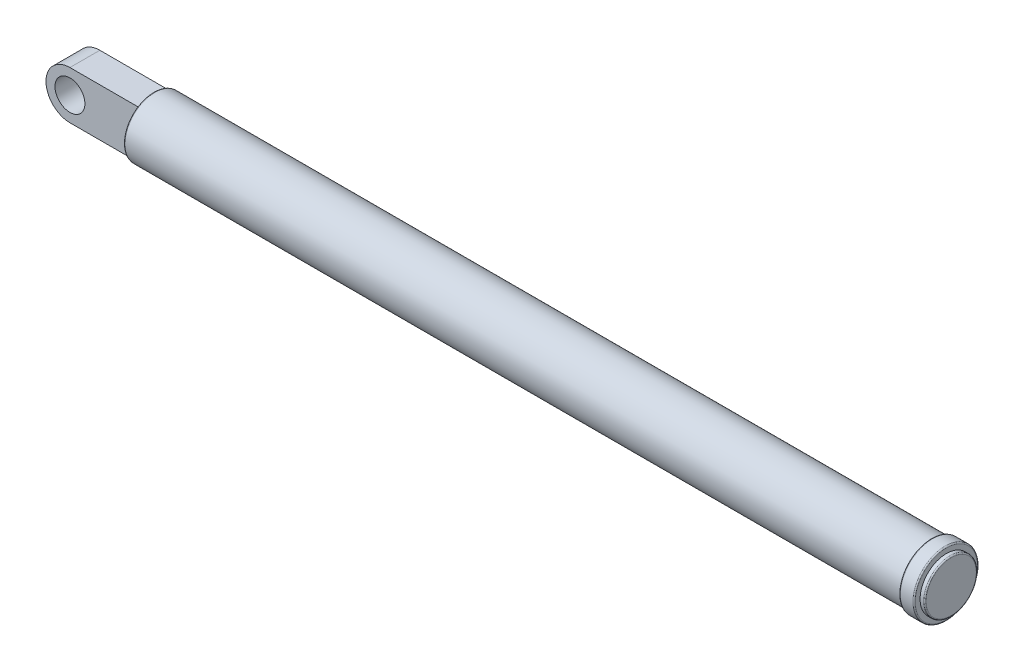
from build123d import *

# Parameters (mm, degrees)
ESQUISSE1_R      = 50
EXTRUSION1_DEPTH = 1300
ESQUISSE2_R      = 54
EXTRUSION2_DEPTH = 25
ESQUISSE3_R      = 44
EXTRUSION3_DEPTH = 8
CONG_1_R         = 2
ESQUISSE4_R      = 25
EXTRUSION4_DEPTH = 25


with BuildPart() as part:
    # Esquisse1 → Extrusion1 (new body)
    with BuildSketch(Plane(origin=(0, 0, 0), x_dir=(0, 0, -1), z_dir=(1, 0, 0))):
        Circle(ESQUISSE1_R)
    extrude(amount=EXTRUSION1_DEPTH)

    # Esquisse2 → Extrusion2 (add)
    with BuildSketch(Plane(origin=(1300, 0, 0), x_dir=(0, 0, -1), z_dir=(1, 0, 0))):
        Circle(ESQUISSE2_R)
    extrude(amount=EXTRUSION2_DEPTH)

    # Esquisse3 → Extrusion3 (add)
    with BuildSketch(Plane(origin=(1325, 0, 0), x_dir=(0, 0, -1), z_dir=(1, 0, 0))):
        Circle(ESQUISSE3_R)
    extrude(amount=EXTRUSION3_DEPTH)

    # Cong_1
    cong_1_edges = [part.edges().sort_by_distance(p)[0] for p in [
        (1333, 0, 44),
        (0, 0, 50),
        (1300, 0, 54),
        (1325, 0, 54),
    ]]
    fillet(cong_1_edges, radius=CONG_1_R)

    # Esquisse4 → Extrusion4 (add, symmetric)
    with BuildSketch(Plane.XY):
        with BuildLine():
            Line((-115, 40), (2, 40))
            Line((2, 40), (2, -40))
            Line((2, -40), (-115, -40))
            ThreePointArc((-115, -40), (-155, 0), (-115, 40))
        make_face()
        with Locations((-115, 0)):
            Circle(ESQUISSE4_R, mode=Mode.SUBTRACT)
    extrude(amount=EXTRUSION4_DEPTH, both=True)


solid = part.part
